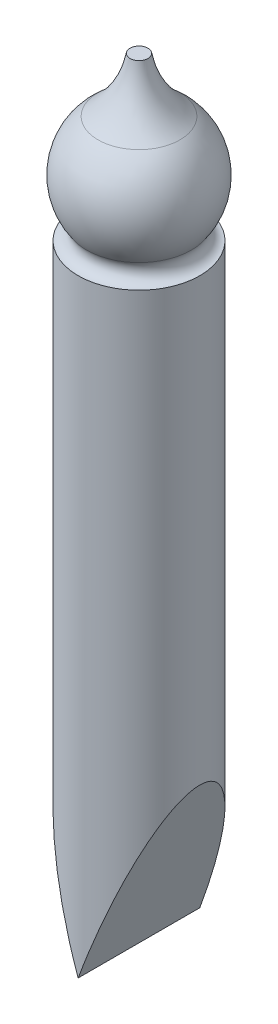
ISO-10303-21;
HEADER;
FILE_DESCRIPTION(('STEP AP214'),'2;1');
FILE_NAME('part.step','',(''),(''),'','','');
FILE_SCHEMA(('AUTOMOTIVE_DESIGN { 1 0 10303 214 1 1 1 1 }'));
ENDSEC;
DATA;
#1=APPLICATION_CONTEXT('core data for automotive mechanical design processes');
#2=APPLICATION_PROTOCOL_DEFINITION('international standard','automotive_design',2000,#1);
#3=PRODUCT_CONTEXT('',#1,'mechanical');
#4=PRODUCT('Part','Part','',(#3));
#5=PRODUCT_RELATED_PRODUCT_CATEGORY('part','',(#4));
#6=PRODUCT_DEFINITION_FORMATION('','',#4);
#7=PRODUCT_DEFINITION_CONTEXT('part definition',#1,'design');
#8=PRODUCT_DEFINITION('design','',#6,#7);
#9=PRODUCT_DEFINITION_SHAPE('','',#8);
#10=(LENGTH_UNIT() NAMED_UNIT(*) SI_UNIT(.MILLI.,.METRE.));
#11=(NAMED_UNIT(*) PLANE_ANGLE_UNIT() SI_UNIT($,.RADIAN.));
#12=(NAMED_UNIT(*) SI_UNIT($,.STERADIAN.) SOLID_ANGLE_UNIT());
#13=UNCERTAINTY_MEASURE_WITH_UNIT(LENGTH_MEASURE(1.E-05),#10,'distance_accuracy_value','');
#14=(GEOMETRIC_REPRESENTATION_CONTEXT(3) GLOBAL_UNCERTAINTY_ASSIGNED_CONTEXT((#13)) GLOBAL_UNIT_ASSIGNED_CONTEXT((#10,
#11,#12)) REPRESENTATION_CONTEXT('',''));
#15=CARTESIAN_POINT('',(0.,0.,0.));
#16=DIRECTION('',(0.,0.,1.));
#17=DIRECTION('',(1.,0.,0.));
#18=AXIS2_PLACEMENT_3D('',#15,#16,#17);
#19=CARTESIAN_POINT('',(0.,30.,0.));
#20=DIRECTION('',(0.,-1.,0.));
#21=DIRECTION('',(0.,0.,-1.));
#22=AXIS2_PLACEMENT_3D('',#19,#20,#21);
#23=CYLINDRICAL_SURFACE('',#22,3.);
#24=CARTESIAN_POINT('',(0.,30.,0.));
#25=DIRECTION('',(0.,1.,0.));
#26=DIRECTION('',(0.,0.,1.));
#27=AXIS2_PLACEMENT_3D('',#24,#25,#26);
#28=CIRCLE('',#27,3.);
#29=CARTESIAN_POINT('',(0.,30.,3.));
#30=VERTEX_POINT('',#29);
#31=EDGE_CURVE('E58',#30,#30,#28,.T.);
#32=ORIENTED_EDGE('',*,*,#31,.F.);
#33=EDGE_LOOP('',(#32));
#34=FACE_BOUND('',#33,.T.);
#35=CARTESIAN_POINT('',(0.,0.,0.));
#36=DIRECTION('',(0.939692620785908,-0.342020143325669,0.));
#37=DIRECTION('',(-0.342020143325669,-0.939692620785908,0.));
#38=AXIS2_PLACEMENT_3D('',#35,#36,#37);
#39=ELLIPSE('',#38,8.77141320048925,3.);
#40=CARTESIAN_POINT('',(0.,0.,-3.));
#41=VERTEX_POINT('',#40);
#42=CARTESIAN_POINT('',(0.,0.,3.));
#43=VERTEX_POINT('',#42);
#44=EDGE_CURVE('E63',#41,#43,#39,.T.);
#45=ORIENTED_EDGE('',*,*,#44,.F.);
#46=CARTESIAN_POINT('',(0.,0.,0.));
#47=DIRECTION('',(0.939692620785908,0.34202014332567,0.));
#48=DIRECTION('',(0.34202014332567,-0.939692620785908,0.));
#49=AXIS2_PLACEMENT_3D('',#46,#47,#48);
#50=ELLIPSE('',#49,8.77141320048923,3.);
#51=EDGE_CURVE('E70',#41,#43,#50,.T.);
#52=ORIENTED_EDGE('',*,*,#51,.T.);
#53=EDGE_LOOP('',(#45,#52));
#54=FACE_BOUND('',#53,.T.);
#55=ADVANCED_FACE('F51',(#34,#54),#23,.T.);
#56=CARTESIAN_POINT('',(0.,30.5563329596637,0.));
#57=DIRECTION('',(0.,-1.,0.));
#58=DIRECTION('',(1.,0.,0.));
#59=AXIS2_PLACEMENT_3D('',#56,#57,#58);
#60=TOROIDAL_SURFACE('',#59,3.03572767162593,0.55747899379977);
#61=CARTESIAN_POINT('',(0.,30.8880148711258,0.));
#62=DIRECTION('',(0.,-1.,0.));
#63=DIRECTION('',(1.,0.,0.));
#64=AXIS2_PLACEMENT_3D('',#61,#62,#63);
#65=CIRCLE('',#64,2.5876540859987);
#66=CARTESIAN_POINT('',(2.5876540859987,30.8880148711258,0.));
#67=VERTEX_POINT('',#66);
#68=EDGE_CURVE('E81',#67,#67,#65,.T.);
#69=ORIENTED_EDGE('',*,*,#68,.T.);
#70=EDGE_LOOP('',(#69));
#71=FACE_BOUND('',#70,.T.);
#72=ORIENTED_EDGE('',*,*,#31,.T.);
#73=EDGE_LOOP('',(#72));
#74=FACE_BOUND('',#73,.T.);
#75=ADVANCED_FACE('F86',(#71,#74),#60,.F.);
#76=CARTESIAN_POINT('',(0.,32.8034994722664,0.));
#77=DIRECTION('',(0.,-1.,0.));
#78=DIRECTION('',(1.,0.,0.));
#79=AXIS2_PLACEMENT_3D('',#76,#77,#78);
#80=SPHERICAL_SURFACE('',#79,3.21947743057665);
#81=CARTESIAN_POINT('',(0.,35.3109590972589,0.));
#82=DIRECTION('',(0.,-1.,0.));
#83=DIRECTION('',(1.,0.,0.));
#84=AXIS2_PLACEMENT_3D('',#81,#82,#83);
#85=CIRCLE('',#84,2.01932690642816);
#86=CARTESIAN_POINT('',(2.01932690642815,35.3109590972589,0.));
#87=VERTEX_POINT('',#86);
#88=EDGE_CURVE('E76',#87,#87,#85,.T.);
#89=CARTESIAN_POINT('',(2.01932690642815,35.3109590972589,0.));
#90=CARTESIAN_POINT('',(2.05929126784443,35.2787759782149,0.));
#91=CARTESIAN_POINT('',(2.09848490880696,35.2456359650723,0.));
#92=CARTESIAN_POINT('',(2.17524409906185,35.177521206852,0.));
#93=CARTESIAN_POINT('',(2.2128096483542,35.1425464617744,0.));
#94=CARTESIAN_POINT('',(2.28622600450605,35.0708412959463,0.));
#95=CARTESIAN_POINT('',(2.32207681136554,35.0341108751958,0.));
#96=CARTESIAN_POINT('',(2.39198194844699,34.9589785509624,0.));
#97=CARTESIAN_POINT('',(2.42603627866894,34.9205766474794,0.));
#98=CARTESIAN_POINT('',(2.49227056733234,34.8421890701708,0.));
#99=CARTESIAN_POINT('',(2.52445052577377,34.8022033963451,0.));
#100=CARTESIAN_POINT('',(2.58686253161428,34.7207396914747,0.));
#101=CARTESIAN_POINT('',(2.61709457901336,34.67926166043,0.));
#102=CARTESIAN_POINT('',(2.67554165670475,34.5949080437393,0.));
#103=CARTESIAN_POINT('',(2.70375668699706,34.5520324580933,0.));
#104=CARTESIAN_POINT('',(2.75810523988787,34.4649817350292,0.));
#105=CARTESIAN_POINT('',(2.78423876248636,34.4208065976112,0.));
#106=CARTESIAN_POINT('',(2.83436456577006,34.3312577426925,0.));
#107=CARTESIAN_POINT('',(2.85835684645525,34.2858840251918,0.));
#108=CARTESIAN_POINT('',(2.90414532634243,34.1940417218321,0.));
#109=CARTESIAN_POINT('',(2.92594152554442,34.1475731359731,0.));
#110=CARTESIAN_POINT('',(2.96728802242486,34.0536473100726,0.));
#111=CARTESIAN_POINT('',(2.98683832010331,34.0061900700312,0.));
#112=CARTESIAN_POINT('',(3.02364832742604,33.9103954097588,0.));
#113=CARTESIAN_POINT('',(3.0409080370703,33.8620579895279,0.));
#114=CARTESIAN_POINT('',(3.07309741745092,33.7646134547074,0.));
#115=CARTESIAN_POINT('',(3.08802708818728,33.7155063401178,0.));
#116=CARTESIAN_POINT('',(3.11552226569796,33.6166346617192,0.));
#117=CARTESIAN_POINT('',(3.12808777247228,33.5668700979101,0.));
#118=CARTESIAN_POINT('',(3.15082590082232,33.4667972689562,0.));
#119=CARTESIAN_POINT('',(3.16099852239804,33.4164890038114,0.));
#120=CARTESIAN_POINT('',(3.17892762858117,33.3154437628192,0.));
#121=CARTESIAN_POINT('',(3.18668411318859,33.2647067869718,0.));
#122=CARTESIAN_POINT('',(3.19976321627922,33.1629200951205,0.));
#123=CARTESIAN_POINT('',(3.20508583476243,33.1118703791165,0.));
#124=CARTESIAN_POINT('',(3.21328503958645,33.0095748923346,0.));
#125=CARTESIAN_POINT('',(3.21616162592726,32.9583291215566,0.));
#126=CARTESIAN_POINT('',(3.21946219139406,32.8557586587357,0.));
#127=CARTESIAN_POINT('',(3.21988617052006,32.8044339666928,0.));
#128=CARTESIAN_POINT('',(3.21828055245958,32.7018229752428,0.));
#129=CARTESIAN_POINT('',(3.21625095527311,32.6505366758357,0.));
#130=CARTESIAN_POINT('',(3.20974282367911,32.548119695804,0.));
#131=CARTESIAN_POINT('',(3.20526428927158,32.4969890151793,0.));
#132=CARTESIAN_POINT('',(3.19386851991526,32.395000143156,0.));
#133=CARTESIAN_POINT('',(3.18695128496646,32.3441419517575,0.));
#134=CARTESIAN_POINT('',(3.17069392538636,32.2428143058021,0.));
#135=CARTESIAN_POINT('',(3.16135380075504,32.1923448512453,0.));
#136=CARTESIAN_POINT('',(3.14027201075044,32.091910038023,0.));
#137=CARTESIAN_POINT('',(3.12853034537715,32.0419446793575,0.));
#138=CARTESIAN_POINT('',(3.10267231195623,31.942632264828,0.));
#139=CARTESIAN_POINT('',(3.08855594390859,31.8932852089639,0.));
#140=CARTESIAN_POINT('',(3.05798077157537,31.7953221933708,0.));
#141=CARTESIAN_POINT('',(3.04152196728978,31.7467062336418,0.));
#142=CARTESIAN_POINT('',(3.00629954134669,31.6503165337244,0.));
#143=CARTESIAN_POINT('',(2.98753591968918,31.6025427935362,0.));
#144=CARTESIAN_POINT('',(2.94774675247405,31.5079467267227,0.));
#145=CARTESIAN_POINT('',(2.92672120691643,31.4611244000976,0.));
#146=CARTESIAN_POINT('',(2.88245623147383,31.368538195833,0.));
#147=CARTESIAN_POINT('',(2.85921680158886,31.3227743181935,0.));
#148=CARTESIAN_POINT('',(2.81057724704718,31.2324095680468,0.));
#149=CARTESIAN_POINT('',(2.78517712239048,31.1878086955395,0.));
#150=CARTESIAN_POINT('',(2.73227397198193,31.0998720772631,0.));
#151=CARTESIAN_POINT('',(2.70477094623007,31.0565363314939,0.));
#152=CARTESIAN_POINT('',(2.64772584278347,30.9712283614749,0.));
#153=CARTESIAN_POINT('',(2.61818376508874,30.9292561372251,0.));
#154=CARTESIAN_POINT('',(2.5876540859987,30.8880148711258,0.));
#155=B_SPLINE_CURVE_WITH_KNOTS('',3,(#89,#90,#91,#92,#93,#94,#95,#96,#97,#98,#99,#100,#101,#102,
#103,#104,#105,#106,#107,#108,#109,#110,#111,#112,#113,#114,#115,#116,#117,#118,#119,#120,#121,
#122,#123,#124,#125,#126,#127,#128,#129,#130,#131,#132,#133,#134,#135,#136,#137,#138,#139,#140,
#141,#142,#143,#144,#145,#146,#147,#148,#149,#150,#151,#152,#153,#154),.UNSPECIFIED.,.F.,.F.,(4,
2,2,2,2,2,2,2,2,2,2,2,2,2,2,2,2,2,2,2,2,2,2,2,2,2,2,2,2,2,2,2,4),(0.,0.153920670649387,
0.307841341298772,0.46176201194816,0.615682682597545,0.769603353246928,0.923524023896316,
1.0774446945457,1.23136536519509,1.38528603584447,1.53920670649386,1.69312737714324,
1.84704804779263,2.00096871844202,2.1548893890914,2.30881005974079,2.46273073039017,
2.61665140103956,2.77057207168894,2.92449274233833,3.07841341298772,3.2323340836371,
3.38625475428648,3.54017542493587,3.69409609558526,3.84801676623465,4.00193743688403,
4.15585810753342,4.3097787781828,4.46369944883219,4.61762011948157,4.77154079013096,
4.92546146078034),.UNSPECIFIED.);
#156=EDGE_CURVE('BSEAM92',#87,#67,#155,.T.);
#157=ORIENTED_EDGE('',*,*,#88,.T.);
#158=ORIENTED_EDGE('',*,*,#68,.F.);
#159=ORIENTED_EDGE('',*,*,#156,.T.);
#160=ORIENTED_EDGE('',*,*,#156,.F.);
#161=EDGE_LOOP('',(#157,#159,#158,#160));
#162=FACE_BOUND('',#161,.T.);
#163=ADVANCED_FACE('F92',(#162),#80,.T.);
#164=CARTESIAN_POINT('',(0.,38.7381663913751,0.));
#165=DIRECTION('',(0.,-1.,0.));
#166=DIRECTION('',(1.,0.,0.));
#167=AXIS2_PLACEMENT_3D('',#164,#165,#166);
#168=TOROIDAL_SURFACE('',#167,4.77935216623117,4.40039649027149);
#169=CARTESIAN_POINT('',(0.,38.,0.));
#170=DIRECTION('',(0.,-1.,0.));
#171=DIRECTION('',(1.,0.,0.));
#172=AXIS2_PLACEMENT_3D('',#169,#170,#171);
#173=CIRCLE('',#172,0.441311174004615);
#174=CARTESIAN_POINT('',(0.441311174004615,38.,0.));
#175=VERTEX_POINT('',#174);
#176=EDGE_CURVE('E73',#175,#175,#173,.T.);
#177=ORIENTED_EDGE('',*,*,#176,.T.);
#178=EDGE_LOOP('',(#177));
#179=FACE_BOUND('',#178,.T.);
#180=ORIENTED_EDGE('',*,*,#88,.F.);
#181=EDGE_LOOP('',(#180));
#182=FACE_BOUND('',#181,.T.);
#183=ADVANCED_FACE('F97',(#179,#182),#168,.F.);
#184=CARTESIAN_POINT('',(0.,38.,0.));
#185=DIRECTION('',(0.,1.,0.));
#186=DIRECTION('',(-1.,0.,0.));
#187=AXIS2_PLACEMENT_3D('',#184,#185,#186);
#188=PLANE('',#187);
#189=ORIENTED_EDGE('',*,*,#176,.F.);
#190=EDGE_LOOP('',(#189));
#191=FACE_BOUND('',#190,.T.);
#192=ADVANCED_FACE('F103',(#191),#188,.T.);
#193=CARTESIAN_POINT('',(0.,0.,-15.));
#194=DIRECTION('',(0.939692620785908,0.34202014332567,0.));
#195=DIRECTION('',(-0.34202014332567,0.939692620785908,0.));
#196=AXIS2_PLACEMENT_3D('',#193,#194,#195);
#197=PLANE('',#196);
#198=DIRECTION('',(0.,0.,-1.));
#199=VECTOR('',#198,1.);
#200=CARTESIAN_POINT('',(0.,0.,0.));
#201=LINE('',#200,#199);
#202=EDGE_CURVE('E12',#43,#41,#201,.T.);
#203=ORIENTED_EDGE('',*,*,#202,.F.);
#204=ORIENTED_EDGE('',*,*,#51,.F.);
#205=EDGE_LOOP('',(#203,#204));
#206=FACE_BOUND('',#205,.T.);
#207=ADVANCED_FACE('F72',(#206),#197,.F.);
#208=CARTESIAN_POINT('',(0.,0.,-15.));
#209=DIRECTION('',(0.939692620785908,-0.342020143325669,0.));
#210=DIRECTION('',(0.342020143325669,0.939692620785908,0.));
#211=AXIS2_PLACEMENT_3D('',#208,#209,#210);
#212=PLANE('',#211);
#213=ORIENTED_EDGE('',*,*,#44,.T.);
#214=ORIENTED_EDGE('',*,*,#202,.T.);
#215=EDGE_LOOP('',(#213,#214));
#216=FACE_BOUND('',#215,.T.);
#217=ADVANCED_FACE('F66',(#216),#212,.T.);
#218=CLOSED_SHELL('',(#55,#75,#163,#183,#192,#207,#217));
#219=MANIFOLD_SOLID_BREP('B2',#218);
#220=ADVANCED_BREP_SHAPE_REPRESENTATION('',(#18,#219),#14);
#221=SHAPE_DEFINITION_REPRESENTATION(#9,#220);
ENDSEC;
END-ISO-10303-21;
